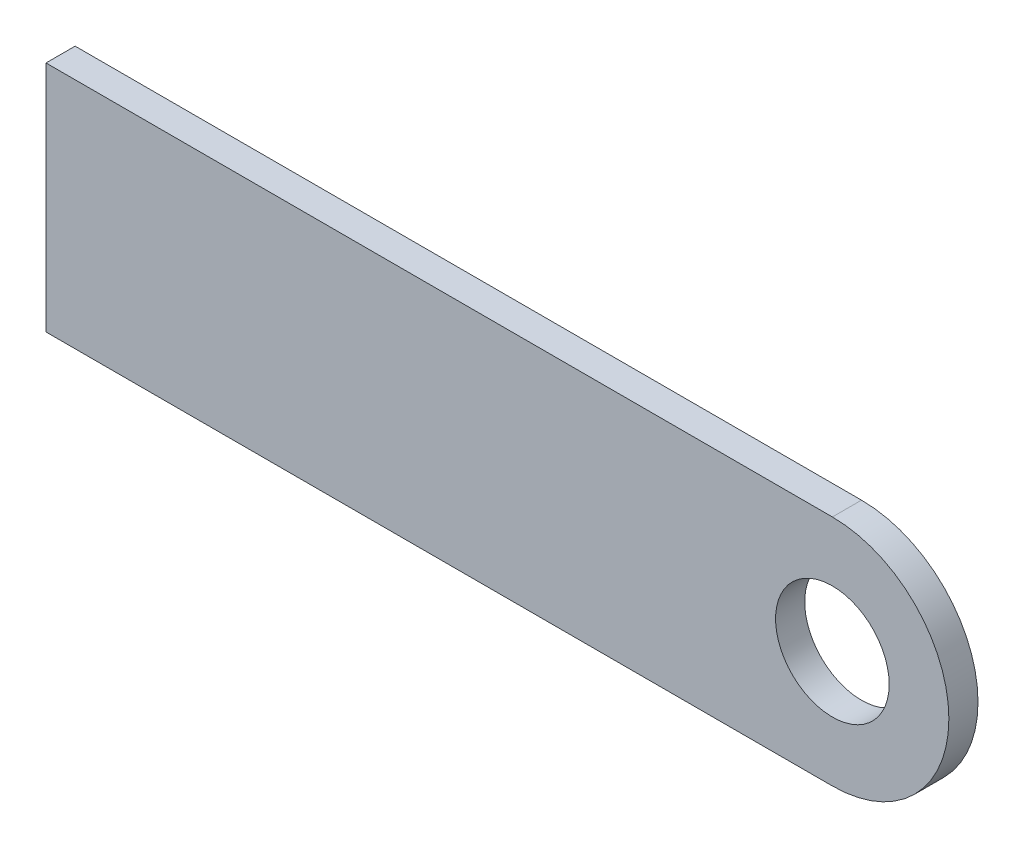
ISO-10303-21;
HEADER;
FILE_DESCRIPTION(('STEP AP214'),'2;1');
FILE_NAME('part.step','',(''),(''),'','','');
FILE_SCHEMA(('AUTOMOTIVE_DESIGN { 1 0 10303 214 1 1 1 1 }'));
ENDSEC;
DATA;
#1=APPLICATION_CONTEXT('core data for automotive mechanical design processes');
#2=APPLICATION_PROTOCOL_DEFINITION('international standard','automotive_design',2000,#1);
#3=PRODUCT_CONTEXT('',#1,'mechanical');
#4=PRODUCT('Part','Part','',(#3));
#5=PRODUCT_RELATED_PRODUCT_CATEGORY('part','',(#4));
#6=PRODUCT_DEFINITION_FORMATION('','',#4);
#7=PRODUCT_DEFINITION_CONTEXT('part definition',#1,'design');
#8=PRODUCT_DEFINITION('design','',#6,#7);
#9=PRODUCT_DEFINITION_SHAPE('','',#8);
#10=(LENGTH_UNIT() NAMED_UNIT(*) SI_UNIT(.MILLI.,.METRE.));
#11=(NAMED_UNIT(*) PLANE_ANGLE_UNIT() SI_UNIT($,.RADIAN.));
#12=(NAMED_UNIT(*) SI_UNIT($,.STERADIAN.) SOLID_ANGLE_UNIT());
#13=UNCERTAINTY_MEASURE_WITH_UNIT(LENGTH_MEASURE(1.E-05),#10,'distance_accuracy_value','');
#14=(GEOMETRIC_REPRESENTATION_CONTEXT(3) GLOBAL_UNCERTAINTY_ASSIGNED_CONTEXT((#13)) GLOBAL_UNIT_ASSIGNED_CONTEXT((#10,
#11,#12)) REPRESENTATION_CONTEXT('',''));
#15=CARTESIAN_POINT('',(0.,0.,0.));
#16=DIRECTION('',(0.,0.,1.));
#17=DIRECTION('',(1.,0.,0.));
#18=AXIS2_PLACEMENT_3D('',#15,#16,#17);
#19=CARTESIAN_POINT('',(67.5,0.,-5.));
#20=DIRECTION('',(0.,0.,1.));
#21=DIRECTION('',(1.,0.,0.));
#22=AXIS2_PLACEMENT_3D('',#19,#20,#21);
#23=CYLINDRICAL_SURFACE('',#22,20.);
#24=CARTESIAN_POINT('',(67.5,0.,0.));
#25=DIRECTION('',(0.,0.,1.));
#26=DIRECTION('',(-1.,0.,0.));
#27=AXIS2_PLACEMENT_3D('',#24,#25,#26);
#28=CIRCLE('',#27,20.);
#29=CARTESIAN_POINT('',(67.5,-20.,0.));
#30=VERTEX_POINT('',#29);
#31=CARTESIAN_POINT('',(67.5,20.,0.));
#32=VERTEX_POINT('',#31);
#33=EDGE_CURVE('E109',#30,#32,#28,.T.);
#34=ORIENTED_EDGE('',*,*,#33,.F.);
#35=DIRECTION('',(0.,0.,1.));
#36=VECTOR('',#35,1.);
#37=CARTESIAN_POINT('',(67.5,-20.,-5.));
#38=LINE('',#37,#36);
#39=CARTESIAN_POINT('',(67.5,-20.,-5.));
#40=VERTEX_POINT('',#39);
#41=EDGE_CURVE('E11',#40,#30,#38,.T.);
#42=ORIENTED_EDGE('',*,*,#41,.F.);
#43=CARTESIAN_POINT('',(67.5,0.,-5.));
#44=DIRECTION('',(0.,0.,1.));
#45=DIRECTION('',(-1.,0.,0.));
#46=AXIS2_PLACEMENT_3D('',#43,#44,#45);
#47=CIRCLE('',#46,20.);
#48=CARTESIAN_POINT('',(67.5,20.,-5.));
#49=VERTEX_POINT('',#48);
#50=EDGE_CURVE('E102',#40,#49,#47,.T.);
#51=ORIENTED_EDGE('',*,*,#50,.T.);
#52=DIRECTION('',(0.,0.,1.));
#53=VECTOR('',#52,1.);
#54=CARTESIAN_POINT('',(67.5,20.,-5.));
#55=LINE('',#54,#53);
#56=EDGE_CURVE('E47',#49,#32,#55,.T.);
#57=ORIENTED_EDGE('',*,*,#56,.T.);
#58=EDGE_LOOP('',(#34,#42,#51,#57));
#59=FACE_BOUND('',#58,.T.);
#60=ADVANCED_FACE('F44',(#59),#23,.T.);
#61=CARTESIAN_POINT('',(-67.5,-20.,-5.));
#62=DIRECTION('',(0.,-1.,0.));
#63=DIRECTION('',(0.,0.,-1.));
#64=AXIS2_PLACEMENT_3D('',#61,#62,#63);
#65=PLANE('',#64);
#66=DIRECTION('',(1.,0.,0.));
#67=VECTOR('',#66,1.);
#68=CARTESIAN_POINT('',(-67.5,-20.,0.));
#69=LINE('',#68,#67);
#70=CARTESIAN_POINT('',(-67.5,-20.,0.));
#71=VERTEX_POINT('',#70);
#72=EDGE_CURVE('E104',#71,#30,#69,.T.);
#73=ORIENTED_EDGE('',*,*,#72,.F.);
#74=DIRECTION('',(0.,0.,1.));
#75=VECTOR('',#74,1.);
#76=CARTESIAN_POINT('',(-67.5,-20.,-5.));
#77=LINE('',#76,#75);
#78=CARTESIAN_POINT('',(-67.5,-20.,-5.));
#79=VERTEX_POINT('',#78);
#80=EDGE_CURVE('E53',#79,#71,#77,.T.);
#81=ORIENTED_EDGE('',*,*,#80,.F.);
#82=DIRECTION('',(1.,0.,0.));
#83=VECTOR('',#82,1.);
#84=CARTESIAN_POINT('',(-67.5,-20.,-5.));
#85=LINE('',#84,#83);
#86=EDGE_CURVE('E99',#79,#40,#85,.T.);
#87=ORIENTED_EDGE('',*,*,#86,.T.);
#88=ORIENTED_EDGE('',*,*,#41,.T.);
#89=EDGE_LOOP('',(#73,#81,#87,#88));
#90=FACE_BOUND('',#89,.T.);
#91=ADVANCED_FACE('F120',(#90),#65,.T.);
#92=CARTESIAN_POINT('',(-67.5,20.,-5.));
#93=DIRECTION('',(-1.,0.,0.));
#94=DIRECTION('',(0.,0.,1.));
#95=AXIS2_PLACEMENT_3D('',#92,#93,#94);
#96=PLANE('',#95);
#97=DIRECTION('',(0.,-1.,0.));
#98=VECTOR('',#97,1.);
#99=CARTESIAN_POINT('',(-67.5,20.,0.));
#100=LINE('',#99,#98);
#101=CARTESIAN_POINT('',(-67.5,20.,0.));
#102=VERTEX_POINT('',#101);
#103=EDGE_CURVE('E94',#102,#71,#100,.T.);
#104=ORIENTED_EDGE('',*,*,#103,.F.);
#105=DIRECTION('',(0.,0.,1.));
#106=VECTOR('',#105,1.);
#107=CARTESIAN_POINT('',(-67.5,20.,-5.));
#108=LINE('',#107,#106);
#109=CARTESIAN_POINT('',(-67.5,20.,-5.));
#110=VERTEX_POINT('',#109);
#111=EDGE_CURVE('E89',#110,#102,#108,.T.);
#112=ORIENTED_EDGE('',*,*,#111,.F.);
#113=DIRECTION('',(0.,-1.,0.));
#114=VECTOR('',#113,1.);
#115=CARTESIAN_POINT('',(-67.5,20.,-5.));
#116=LINE('',#115,#114);
#117=EDGE_CURVE('E92',#110,#79,#116,.T.);
#118=ORIENTED_EDGE('',*,*,#117,.T.);
#119=ORIENTED_EDGE('',*,*,#80,.T.);
#120=EDGE_LOOP('',(#104,#112,#118,#119));
#121=FACE_BOUND('',#120,.T.);
#122=ADVANCED_FACE('F91',(#121),#96,.T.);
#123=CARTESIAN_POINT('',(-67.5,20.,-5.));
#124=DIRECTION('',(0.,1.,0.));
#125=DIRECTION('',(0.,0.,1.));
#126=AXIS2_PLACEMENT_3D('',#123,#124,#125);
#127=PLANE('',#126);
#128=DIRECTION('',(-1.,0.,0.));
#129=VECTOR('',#128,1.);
#130=CARTESIAN_POINT('',(-67.5,20.,0.));
#131=LINE('',#130,#129);
#132=EDGE_CURVE('E112',#32,#102,#131,.T.);
#133=ORIENTED_EDGE('',*,*,#132,.F.);
#134=ORIENTED_EDGE('',*,*,#56,.F.);
#135=DIRECTION('',(-1.,0.,0.));
#136=VECTOR('',#135,1.);
#137=CARTESIAN_POINT('',(-67.5,20.,-5.));
#138=LINE('',#137,#136);
#139=EDGE_CURVE('E98',#49,#110,#138,.T.);
#140=ORIENTED_EDGE('',*,*,#139,.T.);
#141=ORIENTED_EDGE('',*,*,#111,.T.);
#142=EDGE_LOOP('',(#133,#134,#140,#141));
#143=FACE_BOUND('',#142,.T.);
#144=ADVANCED_FACE('F101',(#143),#127,.T.);
#145=CARTESIAN_POINT('',(67.5,0.,-5.));
#146=DIRECTION('',(0.,0.,-1.));
#147=DIRECTION('',(-1.,0.,0.));
#148=AXIS2_PLACEMENT_3D('',#145,#146,#147);
#149=PLANE('',#148);
#150=CARTESIAN_POINT('',(67.5,0.,-5.));
#151=DIRECTION('',(0.,0.,1.));
#152=DIRECTION('',(1.,0.,0.));
#153=AXIS2_PLACEMENT_3D('',#150,#151,#152);
#154=CIRCLE('',#153,9.74999999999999);
#155=CARTESIAN_POINT('',(77.25,0.,-5.));
#156=VERTEX_POINT('',#155);
#157=EDGE_CURVE('E113',#156,#156,#154,.T.);
#158=ORIENTED_EDGE('',*,*,#157,.T.);
#159=EDGE_LOOP('',(#158));
#160=FACE_BOUND('',#159,.T.);
#161=ORIENTED_EDGE('',*,*,#50,.F.);
#162=ORIENTED_EDGE('',*,*,#86,.F.);
#163=ORIENTED_EDGE('',*,*,#117,.F.);
#164=ORIENTED_EDGE('',*,*,#139,.F.);
#165=EDGE_LOOP('',(#161,#162,#163,#164));
#166=FACE_BOUND('',#165,.T.);
#167=ADVANCED_FACE('F97',(#160,#166),#149,.T.);
#168=CARTESIAN_POINT('',(67.5,0.,0.));
#169=DIRECTION('',(0.,0.,-1.));
#170=DIRECTION('',(-1.,0.,0.));
#171=AXIS2_PLACEMENT_3D('',#168,#169,#170);
#172=PLANE('',#171);
#173=CARTESIAN_POINT('',(67.5,0.,0.));
#174=DIRECTION('',(0.,0.,1.));
#175=DIRECTION('',(1.,0.,0.));
#176=AXIS2_PLACEMENT_3D('',#173,#174,#175);
#177=CIRCLE('',#176,9.74999999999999);
#178=CARTESIAN_POINT('',(77.25,0.,0.));
#179=VERTEX_POINT('',#178);
#180=EDGE_CURVE('E150',#179,#179,#177,.T.);
#181=ORIENTED_EDGE('',*,*,#180,.F.);
#182=EDGE_LOOP('',(#181));
#183=FACE_BOUND('',#182,.T.);
#184=ORIENTED_EDGE('',*,*,#33,.T.);
#185=ORIENTED_EDGE('',*,*,#132,.T.);
#186=ORIENTED_EDGE('',*,*,#103,.T.);
#187=ORIENTED_EDGE('',*,*,#72,.T.);
#188=EDGE_LOOP('',(#184,#185,#186,#187));
#189=FACE_BOUND('',#188,.T.);
#190=ADVANCED_FACE('F119',(#183,#189),#172,.F.);
#191=CARTESIAN_POINT('',(67.5,0.,-5.));
#192=DIRECTION('',(0.,0.,1.));
#193=DIRECTION('',(1.,0.,0.));
#194=AXIS2_PLACEMENT_3D('',#191,#192,#193);
#195=CYLINDRICAL_SURFACE('',#194,9.74999999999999);
#196=ORIENTED_EDGE('',*,*,#157,.F.);
#197=EDGE_LOOP('',(#196));
#198=FACE_BOUND('',#197,.T.);
#199=ORIENTED_EDGE('',*,*,#180,.T.);
#200=EDGE_LOOP('',(#199));
#201=FACE_BOUND('',#200,.T.);
#202=ADVANCED_FACE('F138',(#198,#201),#195,.F.);
#203=CLOSED_SHELL('',(#60,#91,#122,#144,#167,#190,#202));
#204=MANIFOLD_SOLID_BREP('B2',#203);
#205=ADVANCED_BREP_SHAPE_REPRESENTATION('',(#18,#204),#14);
#206=SHAPE_DEFINITION_REPRESENTATION(#9,#205);
ENDSEC;
END-ISO-10303-21;
